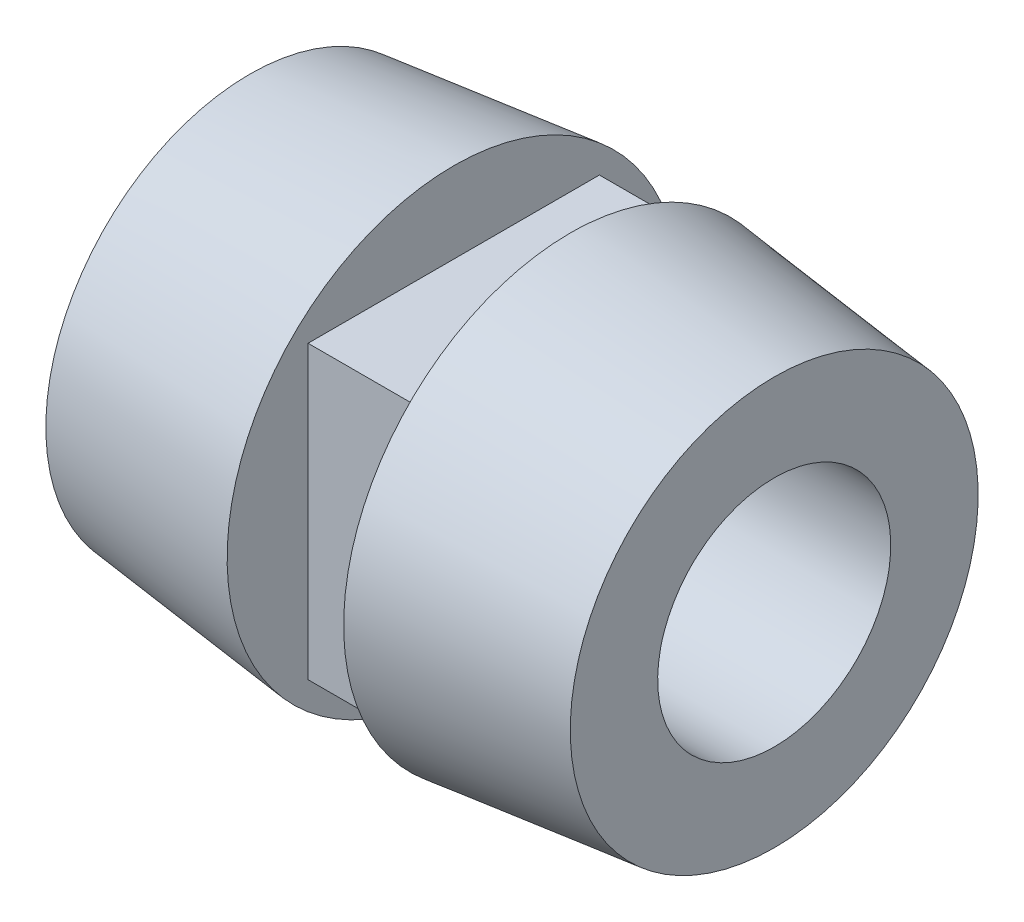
ISO-10303-21;
HEADER;
FILE_DESCRIPTION(('STEP AP214'),'2;1');
FILE_NAME('part.step','',(''),(''),'','','');
FILE_SCHEMA(('AUTOMOTIVE_DESIGN { 1 0 10303 214 1 1 1 1 }'));
ENDSEC;
DATA;
#1=APPLICATION_CONTEXT('core data for automotive mechanical design processes');
#2=APPLICATION_PROTOCOL_DEFINITION('international standard','automotive_design',2000,#1);
#3=PRODUCT_CONTEXT('',#1,'mechanical');
#4=PRODUCT('Part','Part','',(#3));
#5=PRODUCT_RELATED_PRODUCT_CATEGORY('part','',(#4));
#6=PRODUCT_DEFINITION_FORMATION('','',#4);
#7=PRODUCT_DEFINITION_CONTEXT('part definition',#1,'design');
#8=PRODUCT_DEFINITION('design','',#6,#7);
#9=PRODUCT_DEFINITION_SHAPE('','',#8);
#10=(LENGTH_UNIT() NAMED_UNIT(*) SI_UNIT(.MILLI.,.METRE.));
#11=(NAMED_UNIT(*) PLANE_ANGLE_UNIT() SI_UNIT($,.RADIAN.));
#12=(NAMED_UNIT(*) SI_UNIT($,.STERADIAN.) SOLID_ANGLE_UNIT());
#13=UNCERTAINTY_MEASURE_WITH_UNIT(LENGTH_MEASURE(1.E-05),#10,'distance_accuracy_value','');
#14=(GEOMETRIC_REPRESENTATION_CONTEXT(3) GLOBAL_UNCERTAINTY_ASSIGNED_CONTEXT((#13)) GLOBAL_UNIT_ASSIGNED_CONTEXT((#10,
#11,#12)) REPRESENTATION_CONTEXT('',''));
#15=CARTESIAN_POINT('',(0.,0.,0.));
#16=DIRECTION('',(0.,0.,1.));
#17=DIRECTION('',(1.,0.,0.));
#18=AXIS2_PLACEMENT_3D('',#15,#16,#17);
#19=CARTESIAN_POINT('',(-1.33864047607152E-05,4.4798886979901E-11,0.));
#20=DIRECTION('',(0.9999999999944,-3.34660119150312E-06,0.));
#21=DIRECTION('',(3.34660119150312E-06,0.9999999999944,0.));
#22=AXIS2_PLACEMENT_3D('',#19,#20,#21);
#23=CONICAL_SURFACE('',#22,4.,0.110657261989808);
#24=CARTESIAN_POINT('',(-4.50001171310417,1.50597445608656E-05,0.));
#25=DIRECTION('',(-0.9999999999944,3.34660119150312E-06,0.));
#26=DIRECTION('',(-3.34660119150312E-06,-0.9999999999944,0.));
#27=AXIS2_PLACEMENT_3D('',#24,#25,#26);
#28=CIRCLE('',#27,3.4999999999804);
#29=CARTESIAN_POINT('',(-4.50002342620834,-3.49998494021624,0.));
#30=VERTEX_POINT('',#29);
#31=EDGE_CURVE('E12',#30,#30,#28,.T.);
#32=ORIENTED_EDGE('',*,*,#31,.F.);
#33=EDGE_LOOP('',(#32));
#34=FACE_BOUND('',#33,.T.);
#35=CARTESIAN_POINT('',(-1.,1.90053787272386E-06,0.));
#36=DIRECTION('',(1.,0.,0.));
#37=DIRECTION('',(0.,-1.,0.));
#38=AXIS2_PLACEMENT_3D('',#35,#36,#37);
#39=ELLIPSE('',#38,3.88889033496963,3.88889033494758);
#40=CARTESIAN_POINT('',(-1.,-3.88888843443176,0.));
#41=VERTEX_POINT('',#40);
#42=EDGE_CURVE('E122',#41,#41,#39,.T.);
#43=ORIENTED_EDGE('',*,*,#42,.F.);
#44=EDGE_LOOP('',(#43));
#45=FACE_BOUND('',#44,.T.);
#46=ADVANCED_FACE('F33',(#34,#45),#23,.T.);
#47=CARTESIAN_POINT('',(-4.50001171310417,1.50597445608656E-05,0.));
#48=DIRECTION('',(-0.9999999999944,3.34660119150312E-06,0.));
#49=DIRECTION('',(-3.34660119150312E-06,-0.9999999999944,0.));
#50=AXIS2_PLACEMENT_3D('',#47,#48,#49);
#51=CONICAL_SURFACE('',#50,3.4999999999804,1.57079298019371);
#52=CARTESIAN_POINT('',(-4.50001062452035,-1.62746817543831,-1.16247726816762));
#53=CARTESIAN_POINT('',(-4.5000100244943,-1.56216766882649,-1.2538900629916));
#54=CARTESIAN_POINT('',(-4.50001116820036,-1.489098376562,-1.33985382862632));
#55=CARTESIAN_POINT('',(-4.50001165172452,-1.32950321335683,-1.49836482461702));
#56=CARTESIAN_POINT('',(-4.50001098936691,-1.24296123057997,-1.57089576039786));
#57=CARTESIAN_POINT('',(-4.50001010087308,-1.05895968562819,-1.70036700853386));
#58=CARTESIAN_POINT('',(-4.50000987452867,-0.961505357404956,-1.75731475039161));
#59=CARTESIAN_POINT('',(-4.50000926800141,-0.758445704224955,-1.85402410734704));
#60=CARTESIAN_POINT('',(-4.50000888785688,-0.652842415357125,-1.89378999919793));
#61=CARTESIAN_POINT('',(-4.50000814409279,-0.436447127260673,-1.95503427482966));
#62=CARTESIAN_POINT('',(-4.50000778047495,-0.32565458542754,-1.97651074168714));
#63=CARTESIAN_POINT('',(-4.50000703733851,-0.102032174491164,-2.00055903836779));
#64=CARTESIAN_POINT('',(-4.50000665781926,0.0107977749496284,-2.00313012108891));
#65=CARTESIAN_POINT('',(-4.50000590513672,0.235285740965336,-1.98929306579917));
#66=CARTESIAN_POINT('',(-4.50000553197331,0.346943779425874,-1.97288528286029));
#67=CARTESIAN_POINT('',(-4.5000047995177,0.565920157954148,-1.92155683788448));
#68=CARTESIAN_POINT('',(-4.50000444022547,0.673238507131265,-1.88663621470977));
#69=CARTESIAN_POINT('',(-4.50000374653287,0.880489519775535,-1.79927333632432));
#70=CARTESIAN_POINT('',(-4.50000341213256,0.980422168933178,-1.7468310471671));
#71=CARTESIAN_POINT('',(-4.50000277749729,1.17006458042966,-1.6259136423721));
#72=CARTESIAN_POINT('',(-4.50000247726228,1.25977436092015,-1.55743855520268));
#73=CARTESIAN_POINT('',(-4.50000191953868,1.4264246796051,-1.4063992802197));
#74=CARTESIAN_POINT('',(-4.50000166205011,1.50336521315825,-1.3238350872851));
#75=CARTESIAN_POINT('',(-4.5000011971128,1.64229295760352,-1.14696127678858));
#76=CARTESIAN_POINT('',(-4.5000009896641,1.70428015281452,-1.05265164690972));
#77=CARTESIAN_POINT('',(-4.50000063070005,1.81154146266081,-0.85496423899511));
#78=CARTESIAN_POINT('',(-4.50000047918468,1.85681558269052,-0.751586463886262));
#79=CARTESIAN_POINT('',(-4.50000023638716,1.92936555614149,-0.538697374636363));
#80=CARTESIAN_POINT('',(-4.500000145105,1.95664141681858,-0.42918606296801));
#81=CARTESIAN_POINT('',(-4.50000002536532,1.99242062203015,-0.207138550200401));
#82=CARTESIAN_POINT('',(-4.49999999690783,2.0009239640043,-0.0946023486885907));
#83=CARTESIAN_POINT('',(-4.50000000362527,1.99891673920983,0.130300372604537));
#84=CARTESIAN_POINT('',(-4.50000003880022,1.98840616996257,0.242666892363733));
#85=CARTESIAN_POINT('',(-4.50000017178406,1.94866948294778,0.464040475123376));
#86=CARTESIAN_POINT('',(-4.50000026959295,1.91944336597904,0.573047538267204));
#87=CARTESIAN_POINT('',(-4.50000052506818,1.84310522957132,0.784607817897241));
#88=CARTESIAN_POINT('',(-4.5000006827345,1.79599321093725,0.887161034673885));
#89=CARTESIAN_POINT('',(-4.5000010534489,1.6852206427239,1.08290244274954));
#90=CARTESIAN_POINT('',(-4.50000126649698,1.62156009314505,1.17609063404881));
#91=CARTESIAN_POINT('',(-4.50000174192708,1.47949759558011,1.35045665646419));
#92=CARTESIAN_POINT('',(-4.50000200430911,1.40109564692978,1.43163448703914));
#93=CARTESIAN_POINT('',(-4.50000257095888,1.23177595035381,1.57967538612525));
#94=CARTESIAN_POINT('',(-4.50000287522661,1.14085820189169,1.64653845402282));
#95=CARTESIAN_POINT('',(-4.50000351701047,0.949087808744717,1.76405176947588));
#96=CARTESIAN_POINT('',(-4.50000385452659,0.848235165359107,1.81470201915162));
#97=CARTESIAN_POINT('',(-4.50000455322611,0.639457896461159,1.89835189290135));
#98=CARTESIAN_POINT('',(-4.50000491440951,0.531533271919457,1.9313515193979));
#99=CARTESIAN_POINT('',(-4.50000565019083,0.311675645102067,1.97876340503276));
#100=CARTESIAN_POINT('',(-4.50000602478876,0.199742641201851,1.99317565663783));
#101=CARTESIAN_POINT('',(-4.50000677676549,-0.0249542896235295,2.00300364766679));
#102=CARTESIAN_POINT('',(-4.50000715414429,-0.13771821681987,1.99841938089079));
#103=CARTESIAN_POINT('',(-4.50000790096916,-0.360875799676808,1.97038446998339));
#104=CARTESIAN_POINT('',(-4.50000827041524,-0.471269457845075,1.94693384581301));
#105=CARTESIAN_POINT('',(-4.50000899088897,-0.686552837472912,1.88183195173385));
#106=CARTESIAN_POINT('',(-4.50000934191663,-0.791442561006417,1.8401806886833));
#107=CARTESIAN_POINT('',(-4.50001001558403,-0.992740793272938,1.73985978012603));
#108=CARTESIAN_POINT('',(-4.50001033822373,-1.08914928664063,1.68119010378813));
#109=CARTESIAN_POINT('',(-4.50001094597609,-1.27074791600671,1.54849799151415));
#110=CARTESIAN_POINT('',(-4.50001123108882,-1.35593807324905,1.47447558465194));
#111=CARTESIAN_POINT('',(-4.5000117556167,-1.51268209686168,1.31317904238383));
#112=CARTESIAN_POINT('',(-4.50001199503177,-1.58423593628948,1.22590488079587));
#113=CARTESIAN_POINT('',(-4.50001242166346,-1.7116771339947,1.04058073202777));
#114=CARTESIAN_POINT('',(-4.50001260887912,-1.7675642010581,0.942530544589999));
#115=CARTESIAN_POINT('',(-4.50001292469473,-1.862081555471,0.738442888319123));
#116=CARTESIAN_POINT('',(-4.50001305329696,-1.90071251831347,0.63240573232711));
#117=CARTESIAN_POINT('',(-4.50001325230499,-1.95962173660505,0.415363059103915));
#118=CARTESIAN_POINT('',(-4.50001332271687,-1.9799019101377,0.304358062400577));
#119=CARTESIAN_POINT('',(-4.50001338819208,-2.00154169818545,0.0804883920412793));
#120=CARTESIAN_POINT('',(-4.50001338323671,-2.0028966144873,-0.0323767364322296));
#121=CARTESIAN_POINT('',(-4.50001335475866,-1.98663853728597,-0.256775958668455));
#122=CARTESIAN_POINT('',(-4.50001333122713,-1.96901648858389,-0.368309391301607));
#123=CARTESIAN_POINT('',(-4.50001305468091,-1.91529647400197,-0.586736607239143));
#124=CARTESIAN_POINT('',(-4.5000128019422,-1.87922074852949,-0.693635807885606));
#125=CARTESIAN_POINT('',(-4.50001285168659,-1.80651374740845,-0.861073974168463));
#126=CARTESIAN_POINT('',(-4.50001298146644,-1.77516670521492,-0.923961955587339));
#127=CARTESIAN_POINT('',(-4.5000120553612,-1.70604706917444,-1.04610166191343));
#128=CARTESIAN_POINT('',(-4.50001099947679,-1.66827447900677,-1.10535338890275));
#129=CARTESIAN_POINT('',(-4.50001062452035,-1.62746817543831,-1.16247726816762));
#130=B_SPLINE_CURVE_WITH_KNOTS('',3,(#52,#53,#54,#55,#56,#57,#58,#59,#60,#61,#62,#63,#64,#65,
#66,#67,#68,#69,#70,#71,#72,#73,#74,#75,#76,#77,#78,#79,#80,#81,#82,#83,#84,#85,#86,#87,#88,#89,
#90,#91,#92,#93,#94,#95,#96,#97,#98,#99,#100,#101,#102,#103,#104,#105,#106,#107,#108,#109,#110,
#111,#112,#113,#114,#115,#116,#117,#118,#119,#120,#121,#122,#123,#124,#125,#126,#127,#128,#129),
.UNSPECIFIED.,.T.,.F.,(4,2,2,2,2,2,2,2,2,2,2,2,2,2,2,2,2,2,2,2,2,2,2,2,2,2,2,2,2,2,2,2,2,2,2,2,
2,2,4),(0.,0.33676632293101,0.673938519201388,1.01094968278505,1.34787691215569,
1.68483945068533,2.02181530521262,2.35878485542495,2.6957536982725,3.0327231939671,
3.36969209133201,3.70666111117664,4.04363048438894,4.38059974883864,4.71756887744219,
5.05453805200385,5.3915072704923,5.72847647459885,6.06544566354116,6.40241485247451,
6.73938405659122,7.07635327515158,7.41332244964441,7.75029157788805,8.08726084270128,
8.42423021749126,8.76119923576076,9.09816812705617,9.43513762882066,9.77210649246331,
10.1090760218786,10.4460518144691,10.7830144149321,11.1199417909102,11.4569528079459,
11.7941247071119,12.1308912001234,12.3413366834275,12.5517820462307),.UNSPECIFIED.);
#131=CARTESIAN_POINT('',(-4.50001062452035,-1.62746817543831,-1.16247726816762));
#132=VERTEX_POINT('',#131);
#133=EDGE_CURVE('E168',#132,#132,#130,.T.);
#134=ORIENTED_EDGE('',*,*,#133,.T.);
#135=EDGE_LOOP('',(#134));
#136=FACE_BOUND('',#135,.T.);
#137=ORIENTED_EDGE('',*,*,#31,.T.);
#138=EDGE_LOOP('',(#137));
#139=FACE_BOUND('',#138,.T.);
#140=ADVANCED_FACE('F35',(#136,#139),#51,.F.);
#141=CARTESIAN_POINT('',(-1.,4.4799233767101E-11,0.));
#142=DIRECTION('',(1.,0.,0.));
#143=DIRECTION('',(0.,0.,-1.));
#144=AXIS2_PLACEMENT_3D('',#141,#142,#143);
#145=PLANE('',#144);
#146=DIRECTION('',(0.,0.,1.));
#147=VECTOR('',#146,1.);
#148=CARTESIAN_POINT('',(-1.,2.5,2.5));
#149=LINE('',#148,#147);
#150=CARTESIAN_POINT('',(-1.,2.5,-2.5));
#151=VERTEX_POINT('',#150);
#152=CARTESIAN_POINT('',(-1.,2.5,2.5));
#153=VERTEX_POINT('',#152);
#154=EDGE_CURVE('E112',#151,#153,#149,.T.);
#155=ORIENTED_EDGE('',*,*,#154,.F.);
#156=DIRECTION('',(0.,1.,0.));
#157=VECTOR('',#156,1.);
#158=CARTESIAN_POINT('',(-1.,2.5,-2.5));
#159=LINE('',#158,#157);
#160=CARTESIAN_POINT('',(-1.,-2.5,-2.5));
#161=VERTEX_POINT('',#160);
#162=EDGE_CURVE('E56',#161,#151,#159,.T.);
#163=ORIENTED_EDGE('',*,*,#162,.F.);
#164=DIRECTION('',(0.,0.,-1.));
#165=VECTOR('',#164,1.);
#166=CARTESIAN_POINT('',(-1.,-2.5,2.5));
#167=LINE('',#166,#165);
#168=CARTESIAN_POINT('',(-1.,-2.5,2.5));
#169=VERTEX_POINT('',#168);
#170=EDGE_CURVE('E89',#169,#161,#167,.T.);
#171=ORIENTED_EDGE('',*,*,#170,.F.);
#172=DIRECTION('',(0.,-1.,0.));
#173=VECTOR('',#172,1.);
#174=CARTESIAN_POINT('',(-1.,2.5,2.5));
#175=LINE('',#174,#173);
#176=EDGE_CURVE('E104',#153,#169,#175,.T.);
#177=ORIENTED_EDGE('',*,*,#176,.F.);
#178=EDGE_LOOP('',(#155,#163,#171,#177));
#179=FACE_BOUND('',#178,.T.);
#180=ORIENTED_EDGE('',*,*,#42,.T.);
#181=EDGE_LOOP('',(#180));
#182=FACE_BOUND('',#181,.T.);
#183=ADVANCED_FACE('F129',(#179,#182),#145,.T.);
#184=CARTESIAN_POINT('',(1.,4.4799233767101E-11,0.));
#185=DIRECTION('',(1.,0.,0.));
#186=DIRECTION('',(0.,0.,-1.));
#187=AXIS2_PLACEMENT_3D('',#184,#185,#186);
#188=PLANE('',#187);
#189=DIRECTION('',(0.,-1.,0.));
#190=VECTOR('',#189,1.);
#191=CARTESIAN_POINT('',(1.,2.5,2.5));
#192=LINE('',#191,#190);
#193=CARTESIAN_POINT('',(1.,2.5,2.5));
#194=VERTEX_POINT('',#193);
#195=CARTESIAN_POINT('',(1.,-2.5,2.5));
#196=VERTEX_POINT('',#195);
#197=EDGE_CURVE('E64',#194,#196,#192,.T.);
#198=ORIENTED_EDGE('',*,*,#197,.T.);
#199=DIRECTION('',(0.,0.,-1.));
#200=VECTOR('',#199,1.);
#201=CARTESIAN_POINT('',(1.,-2.5,2.5));
#202=LINE('',#201,#200);
#203=CARTESIAN_POINT('',(1.,-2.5,-2.5));
#204=VERTEX_POINT('',#203);
#205=EDGE_CURVE('E88',#196,#204,#202,.T.);
#206=ORIENTED_EDGE('',*,*,#205,.T.);
#207=DIRECTION('',(0.,1.,0.));
#208=VECTOR('',#207,1.);
#209=CARTESIAN_POINT('',(1.,2.5,-2.5));
#210=LINE('',#209,#208);
#211=CARTESIAN_POINT('',(1.,2.5,-2.5));
#212=VERTEX_POINT('',#211);
#213=EDGE_CURVE('E98',#204,#212,#210,.T.);
#214=ORIENTED_EDGE('',*,*,#213,.T.);
#215=DIRECTION('',(0.,0.,1.));
#216=VECTOR('',#215,1.);
#217=CARTESIAN_POINT('',(1.,2.5,2.5));
#218=LINE('',#217,#216);
#219=EDGE_CURVE('E102',#212,#194,#218,.T.);
#220=ORIENTED_EDGE('',*,*,#219,.T.);
#221=EDGE_LOOP('',(#198,#206,#214,#220));
#222=FACE_BOUND('',#221,.T.);
#223=CARTESIAN_POINT('',(1.,-1.90054002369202E-06,0.));
#224=DIRECTION('',(1.,0.,0.));
#225=DIRECTION('',(0.,1.,0.));
#226=AXIS2_PLACEMENT_3D('',#223,#224,#225);
#227=ELLIPSE('',#226,3.8888874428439,3.88888744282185);
#228=CARTESIAN_POINT('',(1.,3.88888554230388,0.));
#229=VERTEX_POINT('',#228);
#230=EDGE_CURVE('E117',#229,#229,#227,.T.);
#231=ORIENTED_EDGE('',*,*,#230,.F.);
#232=EDGE_LOOP('',(#231));
#233=FACE_BOUND('',#232,.T.);
#234=ADVANCED_FACE('F96',(#222,#233),#188,.F.);
#235=CARTESIAN_POINT('',(-1.,2.5,2.5));
#236=DIRECTION('',(0.,0.,1.));
#237=DIRECTION('',(0.,-1.,0.));
#238=AXIS2_PLACEMENT_3D('',#235,#236,#237);
#239=PLANE('',#238);
#240=ORIENTED_EDGE('',*,*,#197,.F.);
#241=DIRECTION('',(1.,0.,0.));
#242=VECTOR('',#241,1.);
#243=CARTESIAN_POINT('',(-1.,2.5,2.5));
#244=LINE('',#243,#242);
#245=EDGE_CURVE('E115',#153,#194,#244,.T.);
#246=ORIENTED_EDGE('',*,*,#245,.F.);
#247=ORIENTED_EDGE('',*,*,#176,.T.);
#248=DIRECTION('',(1.,0.,0.));
#249=VECTOR('',#248,1.);
#250=CARTESIAN_POINT('',(-1.,-2.5,2.5));
#251=LINE('',#250,#249);
#252=EDGE_CURVE('E93',#169,#196,#251,.T.);
#253=ORIENTED_EDGE('',*,*,#252,.T.);
#254=EDGE_LOOP('',(#240,#246,#247,#253));
#255=FACE_BOUND('',#254,.T.);
#256=ADVANCED_FACE('F152',(#255),#239,.T.);
#257=CARTESIAN_POINT('',(-1.,2.5,2.5));
#258=DIRECTION('',(0.,1.,0.));
#259=DIRECTION('',(0.,0.,1.));
#260=AXIS2_PLACEMENT_3D('',#257,#258,#259);
#261=PLANE('',#260);
#262=ORIENTED_EDGE('',*,*,#219,.F.);
#263=DIRECTION('',(1.,0.,0.));
#264=VECTOR('',#263,1.);
#265=CARTESIAN_POINT('',(-1.,2.5,-2.5));
#266=LINE('',#265,#264);
#267=EDGE_CURVE('E92',#151,#212,#266,.T.);
#268=ORIENTED_EDGE('',*,*,#267,.F.);
#269=ORIENTED_EDGE('',*,*,#154,.T.);
#270=ORIENTED_EDGE('',*,*,#245,.T.);
#271=EDGE_LOOP('',(#262,#268,#269,#270));
#272=FACE_BOUND('',#271,.T.);
#273=ADVANCED_FACE('F155',(#272),#261,.T.);
#274=CARTESIAN_POINT('',(-1.,2.5,-2.5));
#275=DIRECTION('',(0.,0.,-1.));
#276=DIRECTION('',(0.,1.,0.));
#277=AXIS2_PLACEMENT_3D('',#274,#275,#276);
#278=PLANE('',#277);
#279=ORIENTED_EDGE('',*,*,#213,.F.);
#280=DIRECTION('',(1.,0.,0.));
#281=VECTOR('',#280,1.);
#282=CARTESIAN_POINT('',(-1.,-2.5,-2.5));
#283=LINE('',#282,#281);
#284=EDGE_CURVE('E86',#161,#204,#283,.T.);
#285=ORIENTED_EDGE('',*,*,#284,.F.);
#286=ORIENTED_EDGE('',*,*,#162,.T.);
#287=ORIENTED_EDGE('',*,*,#267,.T.);
#288=EDGE_LOOP('',(#279,#285,#286,#287));
#289=FACE_BOUND('',#288,.T.);
#290=ADVANCED_FACE('F101',(#289),#278,.T.);
#291=CARTESIAN_POINT('',(-1.,-2.5,2.5));
#292=DIRECTION('',(0.,-1.,0.));
#293=DIRECTION('',(0.,0.,-1.));
#294=AXIS2_PLACEMENT_3D('',#291,#292,#293);
#295=PLANE('',#294);
#296=ORIENTED_EDGE('',*,*,#205,.F.);
#297=ORIENTED_EDGE('',*,*,#252,.F.);
#298=ORIENTED_EDGE('',*,*,#170,.T.);
#299=ORIENTED_EDGE('',*,*,#284,.T.);
#300=EDGE_LOOP('',(#296,#297,#298,#299));
#301=FACE_BOUND('',#300,.T.);
#302=ADVANCED_FACE('F87',(#301),#295,.T.);
#303=CARTESIAN_POINT('',(4.49999999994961,-1.50597053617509E-05,0.));
#304=DIRECTION('',(-0.9999999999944,3.34660119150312E-06,0.));
#305=DIRECTION('',(-3.34660119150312E-06,-0.9999999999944,0.));
#306=AXIS2_PLACEMENT_3D('',#303,#304,#305);
#307=CONICAL_SURFACE('',#306,0.,1.57079298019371);
#308=CARTESIAN_POINT('',(4.49999999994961,2.,0.));
#309=CARTESIAN_POINT('',(4.49999999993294,1.99999501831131,0.112340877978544));
#310=CARTESIAN_POINT('',(4.49999996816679,1.9905028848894,0.224763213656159));
#311=CARTESIAN_POINT('',(4.49999984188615,1.95276860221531,0.446511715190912));
#312=CARTESIAN_POINT('',(4.49999974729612,1.92450388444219,0.555833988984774));
#313=CARTESIAN_POINT('',(4.49999949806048,1.85002906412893,0.768137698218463));
#314=CARTESIAN_POINT('',(4.49999934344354,1.80382753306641,0.871122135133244));
#315=CARTESIAN_POINT('',(4.49999897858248,1.69480235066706,1.06784381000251));
#316=CARTESIAN_POINT('',(4.49999876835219,1.63198283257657,1.16158333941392));
#317=CARTESIAN_POINT('',(4.49999829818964,1.49149220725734,1.33719709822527));
#318=CARTESIAN_POINT('',(4.49999803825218,1.41381954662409,1.41907008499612));
#319=CARTESIAN_POINT('',(4.49999747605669,1.24582829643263,1.56861687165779));
#320=CARTESIAN_POINT('',(4.49999717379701,1.15550921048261,1.63629011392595));
#321=CARTESIAN_POINT('',(4.49999653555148,0.964793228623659,1.75551140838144));
#322=CARTESIAN_POINT('',(4.49999619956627,0.864396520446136,1.80705976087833));
#323=CARTESIAN_POINT('',(4.4999955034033,0.656374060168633,1.89256952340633));
#324=CARTESIAN_POINT('',(4.49999514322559,0.548748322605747,1.92653096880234));
#325=CARTESIAN_POINT('',(4.49999440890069,0.329322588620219,1.97590307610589));
#326=CARTESIAN_POINT('',(4.49999403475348,0.217522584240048,1.9913137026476));
#327=CARTESIAN_POINT('',(4.49999328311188,-0.00707760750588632,2.00314657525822));
#328=CARTESIAN_POINT('',(4.49999290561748,-0.119877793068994,1.99956885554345));
#329=CARTESIAN_POINT('',(4.49999215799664,-0.34327652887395,1.97352667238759));
#330=CARTESIAN_POINT('',(4.49999178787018,-0.453875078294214,1.95106220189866));
#331=CARTESIAN_POINT('',(4.49999106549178,-0.669731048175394,1.88788417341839));
#332=CARTESIAN_POINT('',(4.49999071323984,-0.774988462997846,1.84717059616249));
#333=CARTESIAN_POINT('',(4.4999900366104,-0.977174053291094,1.74865010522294));
#334=CARTESIAN_POINT('',(4.49998971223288,-1.07410223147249,1.69084319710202));
#335=CARTESIAN_POINT('',(4.49998910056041,-1.25687784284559,1.55977703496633));
#336=CARTESIAN_POINT('',(4.49998881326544,-1.34272528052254,1.48651778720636));
#337=CARTESIAN_POINT('',(4.49998828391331,-1.50090251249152,1.32662653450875));
#338=CARTESIAN_POINT('',(4.49998804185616,-1.57323230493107,1.23999452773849));
#339=CARTESIAN_POINT('',(4.499987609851,-1.70232101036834,1.05581697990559));
#340=CARTESIAN_POINT('',(4.49998741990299,-1.75907992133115,0.95827143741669));
#341=CARTESIAN_POINT('',(4.49998709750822,-1.85541563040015,0.755035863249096));
#342=CARTESIAN_POINT('',(4.49998696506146,-1.89499242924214,0.649345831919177));
#343=CARTESIAN_POINT('',(4.49998676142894,-1.9558404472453,0.432821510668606));
#344=CARTESIAN_POINT('',(4.49998669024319,-1.97711166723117,0.321987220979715));
#345=CARTESIAN_POINT('',(4.49998661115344,-2.00074470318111,0.0983206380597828));
#346=CARTESIAN_POINT('',(4.49998660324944,-2.00310651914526,-0.0145116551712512));
#347=CARTESIAN_POINT('',(4.49998665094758,-1.98885370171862,-0.238971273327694));
#348=CARTESIAN_POINT('',(4.49998670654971,-1.97223906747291,-0.350598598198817));
#349=CARTESIAN_POINT('',(4.49998687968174,-1.92050498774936,-0.569479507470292));
#350=CARTESIAN_POINT('',(4.49998699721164,-1.88538554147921,-0.676733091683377));
#351=CARTESIAN_POINT('',(4.49998729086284,-1.7976387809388,-0.883821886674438));
#352=CARTESIAN_POINT('',(4.49998746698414,-1.74501146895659,-0.983657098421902));
#353=CARTESIAN_POINT('',(4.49998787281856,-1.62374291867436,-1.17307512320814));
#354=CARTESIAN_POINT('',(4.49998810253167,-1.55510168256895,-1.26265793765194));
#355=CARTESIAN_POINT('',(4.49998860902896,-1.40375377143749,-1.42902822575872));
#356=CARTESIAN_POINT('',(4.49998888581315,-1.32104709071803,-1.50581569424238));
#357=CARTESIAN_POINT('',(4.49998947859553,-1.14391608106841,-1.64441549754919));
#358=CARTESIAN_POINT('',(4.49998979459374,-1.04949174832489,-1.70622782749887));
#359=CARTESIAN_POINT('',(4.49999045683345,-0.85160599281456,-1.81312259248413));
#360=CARTESIAN_POINT('',(4.49999080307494,-0.748144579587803,-1.85820504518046));
#361=CARTESIAN_POINT('',(4.49999151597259,-0.535121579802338,-1.93036037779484));
#362=CARTESIAN_POINT('',(4.49999188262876,-0.425559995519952,-1.95743326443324));
#363=CARTESIAN_POINT('',(4.49999262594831,-0.203446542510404,-1.99280100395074));
#364=CARTESIAN_POINT('',(4.49999300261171,-0.0908946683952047,-2.00109582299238));
#365=CARTESIAN_POINT('',(4.49999375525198,0.134003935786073,-1.99867186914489));
#366=CARTESIAN_POINT('',(4.49999413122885,0.246350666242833,-1.98795313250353));
#367=CARTESIAN_POINT('',(4.49999487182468,0.467650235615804,-1.94780635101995));
#368=CARTESIAN_POINT('',(4.49999523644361,0.576603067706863,-1.91837826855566));
#369=CARTESIAN_POINT('',(4.49999594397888,0.788023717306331,-1.84164749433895));
#370=CARTESIAN_POINT('',(4.49999628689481,0.89049141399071,-1.79434446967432));
#371=CARTESIAN_POINT('',(4.49999694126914,1.08602688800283,-1.68320860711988));
#372=CARTESIAN_POINT('',(4.49999725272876,1.17909503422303,-1.6193764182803));
#373=CARTESIAN_POINT('',(4.49999783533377,1.35318491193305,-1.477001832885));
#374=CARTESIAN_POINT('',(4.49999810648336,1.43420790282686,-1.39846097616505));
#375=CARTESIAN_POINT('',(4.49999860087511,1.58193852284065,-1.22886860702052));
#376=CARTESIAN_POINT('',(4.49999882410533,1.64864258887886,-1.13781398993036));
#377=CARTESIAN_POINT('',(4.49999921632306,1.76584229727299,-0.945762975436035));
#378=CARTESIAN_POINT('',(4.49999938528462,1.81633018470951,-0.844761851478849));
#379=CARTESIAN_POINT('',(4.49999966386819,1.89957454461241,-0.635796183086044));
#380=CARTESIAN_POINT('',(4.49999977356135,1.93235227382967,-0.52784016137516));
#381=CARTESIAN_POINT('',(4.49999990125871,1.97050988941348,-0.349330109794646));
#382=CARTESIAN_POINT('',(4.49999993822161,1.98155487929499,-0.279935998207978));
#383=CARTESIAN_POINT('',(4.49999998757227,1.99630149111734,-0.140371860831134));
#384=CARTESIAN_POINT('',(4.49999999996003,2.00000311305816,-0.0702018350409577));
#385=CARTESIAN_POINT('',(4.49999999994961,2.,0.));
#386=B_SPLINE_CURVE_WITH_KNOTS('',3,(#308,#309,#310,#311,#312,#313,#314,#315,#316,#317,#318,
#319,#320,#321,#322,#323,#324,#325,#326,#327,#328,#329,#330,#331,#332,#333,#334,#335,#336,#337,
#338,#339,#340,#341,#342,#343,#344,#345,#346,#347,#348,#349,#350,#351,#352,#353,#354,#355,#356,
#357,#358,#359,#360,#361,#362,#363,#364,#365,#366,#367,#368,#369,#370,#371,#372,#373,#374,#375,
#376,#377,#378,#379,#380,#381,#382,#383,#384,#385),.UNSPECIFIED.,.T.,.F.,(4,2,2,2,2,2,2,2,2,2,2,
2,2,2,2,2,2,2,2,2,2,2,2,2,2,2,2,2,2,2,2,2,2,2,2,2,2,2,4),(0.,0.336766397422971,
0.673938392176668,1.01094946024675,1.34787678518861,1.68483936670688,2.02181517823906,
2.358784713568,2.69575357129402,3.0327230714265,3.36969196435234,3.70666098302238,
4.04363035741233,4.38059962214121,4.71756875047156,5.05453792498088,5.39150714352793,
5.72847634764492,6.0654455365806,6.40241472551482,6.73938392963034,7.07635314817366,
7.41332232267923,7.7502914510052,8.0872607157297,8.42423009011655,8.76119910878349,
9.09816800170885,9.43513750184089,9.77210635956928,10.1090758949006,10.446051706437,
10.7830142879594,11.1199416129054,11.4569526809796,11.7941246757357,12.1308910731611,
12.3413364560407,12.5517818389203),.UNSPECIFIED.);
#387=CARTESIAN_POINT('',(4.49999999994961,2.,0.));
#388=VERTEX_POINT('',#387);
#389=EDGE_CURVE('E38',#388,#388,#386,.T.);
#390=ORIENTED_EDGE('',*,*,#389,.F.);
#391=EDGE_LOOP('',(#390));
#392=FACE_BOUND('',#391,.T.);
#393=CARTESIAN_POINT('',(4.49998828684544,-1.50596661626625E-05,0.));
#394=DIRECTION('',(-0.9999999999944,3.34660119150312E-06,0.));
#395=DIRECTION('',(-3.34660119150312E-06,-0.9999999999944,0.));
#396=AXIS2_PLACEMENT_3D('',#393,#394,#395);
#397=CIRCLE('',#396,3.4999999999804);
#398=CARTESIAN_POINT('',(4.49997657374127,-3.50001505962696,0.));
#399=VERTEX_POINT('',#398);
#400=EDGE_CURVE('E48',#399,#399,#397,.T.);
#401=ORIENTED_EDGE('',*,*,#400,.F.);
#402=EDGE_LOOP('',(#401));
#403=FACE_BOUND('',#402,.T.);
#404=ADVANCED_FACE('F142',(#392,#403),#307,.T.);
#405=CARTESIAN_POINT('',(4.49998828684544,-1.50596661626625E-05,0.));
#406=DIRECTION('',(-0.9999999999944,3.34660119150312E-06,0.));
#407=DIRECTION('',(-3.34660119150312E-06,-0.9999999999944,0.));
#408=AXIS2_PLACEMENT_3D('',#405,#406,#407);
#409=CONICAL_SURFACE('',#408,3.4999999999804,0.110657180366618);
#410=ORIENTED_EDGE('',*,*,#230,.T.);
#411=EDGE_LOOP('',(#410));
#412=FACE_BOUND('',#411,.T.);
#413=ORIENTED_EDGE('',*,*,#400,.T.);
#414=EDGE_LOOP('',(#413));
#415=FACE_BOUND('',#414,.T.);
#416=ADVANCED_FACE('F139',(#412,#415),#409,.T.);
#417=CARTESIAN_POINT('',(-4.50002342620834,0.,0.));
#418=DIRECTION('',(1.,0.,0.));
#419=DIRECTION('',(0.,0.,-1.));
#420=AXIS2_PLACEMENT_3D('',#417,#418,#419);
#421=CYLINDRICAL_SURFACE('',#420,2.);
#422=ORIENTED_EDGE('',*,*,#389,.T.);
#423=EDGE_LOOP('',(#422));
#424=FACE_BOUND('',#423,.T.);
#425=ORIENTED_EDGE('',*,*,#133,.F.);
#426=EDGE_LOOP('',(#425));
#427=FACE_BOUND('',#426,.T.);
#428=ADVANCED_FACE('F141',(#424,#427),#421,.F.);
#429=CLOSED_SHELL('',(#46,#140,#183,#234,#256,#273,#290,#302,#404,#416,#428));
#430=MANIFOLD_SOLID_BREP('B2',#429);
#431=ADVANCED_BREP_SHAPE_REPRESENTATION('',(#18,#430),#14);
#432=SHAPE_DEFINITION_REPRESENTATION(#9,#431);
ENDSEC;
END-ISO-10303-21;
